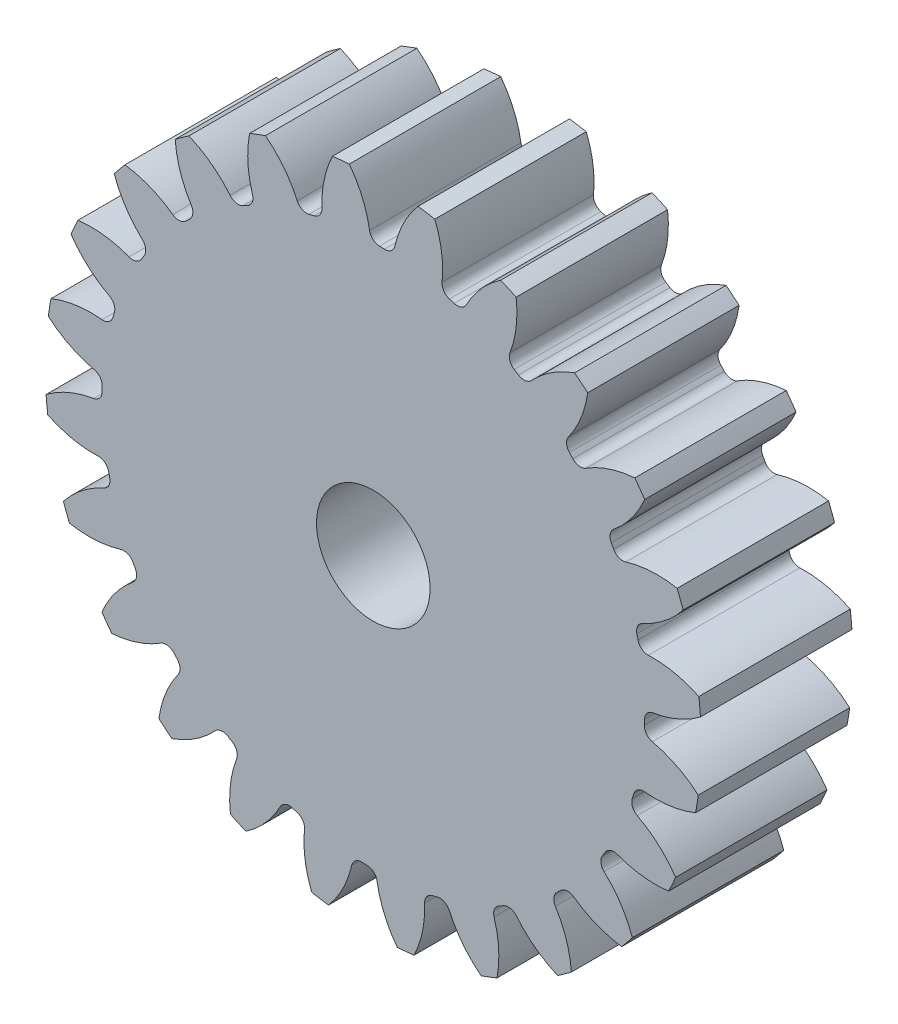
from build123d import *

# Parameters (mm, degrees)
SKETCH3_R         = 220.133333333
GEARBODY_DEPTH    = 101.6
TOOTHCUT_DEPTH    = 328.475081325
CIRPATTERN1_COUNT = 24
BOREDIA_R         = 38.1
BORE_DEPTH        = 12700


with BuildPart() as part:
    # Sketch3 → gearBody (new body)
    with BuildSketch(Plane.XY):
        Circle(SKETCH3_R)
    extrude(amount=GEARBODY_DEPTH)

    # Sketch2 → toothCut (cut, through all)
    with BuildSketch(Plane.XY):
        with BuildLine():
            ThreePointArc((181.879087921, -7.492117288), (181.940500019, -5.812821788), (181.986407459, -4.133030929))
            ThreePointArc((181.986407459, -4.133030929), (183.680950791, 0.238638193), (187.780099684, 2.514587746))
            ThreePointArc((187.780099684, 2.514587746), (204.835283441, 7.500276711), (220.133333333, 16.539416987))
            ThreePointArc((220.133333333, 16.539416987), (220.641212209, -7.049271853), (218.628634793, -30.557434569))
            ThreePointArc((218.628634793, -30.557434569), (203.938778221, -20.560209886), (187.236627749, -14.496006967))
            ThreePointArc((187.236627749, -14.496006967), (183.291119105, -11.963038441), (181.879087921, -7.492117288))
        make_face()
    toothcut = extrude(amount=TOOTHCUT_DEPTH, mode=Mode.SUBTRACT)

    # CirPattern1: toothCut ×24 about axis
    cirpattern1_axis = Axis((0, 0, 0), (0, 0, 1))
    for i in range(1, CIRPATTERN1_COUNT):
        add(toothcut.rotate(cirpattern1_axis, i * 360 / CIRPATTERN1_COUNT), mode=Mode.SUBTRACT)

    # boreDia → bore (cut, symmetric)
    with BuildSketch(Plane.XY):
        Circle(BOREDIA_R)
    extrude(amount=BORE_DEPTH, both=True, mode=Mode.SUBTRACT)


solid = part.part
